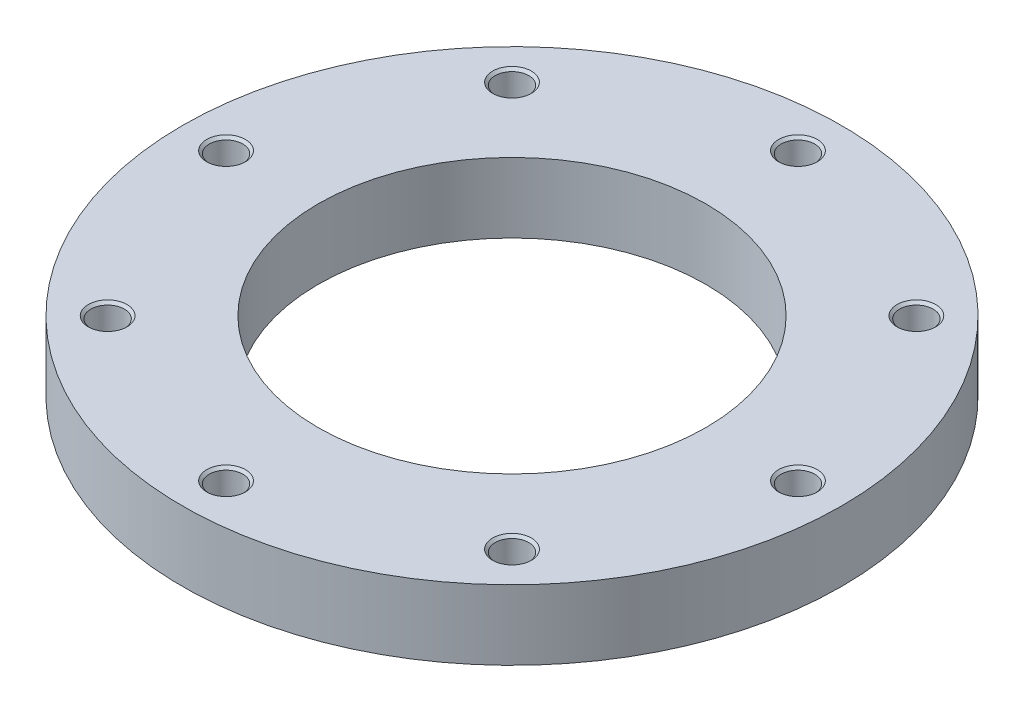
ISO-10303-21;
HEADER;
FILE_DESCRIPTION(('STEP AP214'),'2;1');
FILE_NAME('part.step','',(''),(''),'','','');
FILE_SCHEMA(('AUTOMOTIVE_DESIGN { 1 0 10303 214 1 1 1 1 }'));
ENDSEC;
DATA;
#1=APPLICATION_CONTEXT('core data for automotive mechanical design processes');
#2=APPLICATION_PROTOCOL_DEFINITION('international standard','automotive_design',2000,#1);
#3=PRODUCT_CONTEXT('',#1,'mechanical');
#4=PRODUCT('Part','Part','',(#3));
#5=PRODUCT_RELATED_PRODUCT_CATEGORY('part','',(#4));
#6=PRODUCT_DEFINITION_FORMATION('','',#4);
#7=PRODUCT_DEFINITION_CONTEXT('part definition',#1,'design');
#8=PRODUCT_DEFINITION('design','',#6,#7);
#9=PRODUCT_DEFINITION_SHAPE('','',#8);
#10=(LENGTH_UNIT() NAMED_UNIT(*) SI_UNIT(.MILLI.,.METRE.));
#11=(NAMED_UNIT(*) PLANE_ANGLE_UNIT() SI_UNIT($,.RADIAN.));
#12=(NAMED_UNIT(*) SI_UNIT($,.STERADIAN.) SOLID_ANGLE_UNIT());
#13=UNCERTAINTY_MEASURE_WITH_UNIT(LENGTH_MEASURE(1.E-05),#10,'distance_accuracy_value','');
#14=(GEOMETRIC_REPRESENTATION_CONTEXT(3) GLOBAL_UNCERTAINTY_ASSIGNED_CONTEXT((#13)) GLOBAL_UNIT_ASSIGNED_CONTEXT((#10,
#11,#12)) REPRESENTATION_CONTEXT('',''));
#15=CARTESIAN_POINT('',(0.,0.,0.));
#16=DIRECTION('',(0.,0.,1.));
#17=DIRECTION('',(1.,0.,0.));
#18=AXIS2_PLACEMENT_3D('',#15,#16,#17);
#19=CARTESIAN_POINT('',(0.,18.,0.));
#20=DIRECTION('',(0.,-1.,0.));
#21=DIRECTION('',(1.,0.,0.));
#22=AXIS2_PLACEMENT_3D('',#19,#20,#21);
#23=CYLINDRICAL_SURFACE('',#22,170.);
#24=CARTESIAN_POINT('',(0.,0.,0.));
#25=DIRECTION('',(0.,1.,0.));
#26=DIRECTION('',(1.,0.,0.));
#27=AXIS2_PLACEMENT_3D('',#24,#25,#26);
#28=CIRCLE('',#27,170.);
#29=CARTESIAN_POINT('',(170.,0.,0.));
#30=VERTEX_POINT('',#29);
#31=EDGE_CURVE('E9',#30,#30,#28,.T.);
#32=ORIENTED_EDGE('',*,*,#31,.T.);
#33=EDGE_LOOP('',(#32));
#34=FACE_BOUND('',#33,.T.);
#35=CARTESIAN_POINT('',(0.,36.,0.));
#36=DIRECTION('',(0.,1.,0.));
#37=DIRECTION('',(1.,0.,0.));
#38=AXIS2_PLACEMENT_3D('',#35,#36,#37);
#39=CIRCLE('',#38,170.);
#40=CARTESIAN_POINT('',(170.,36.,0.));
#41=VERTEX_POINT('',#40);
#42=EDGE_CURVE('E179',#41,#41,#39,.T.);
#43=ORIENTED_EDGE('',*,*,#42,.F.);
#44=EDGE_LOOP('',(#43));
#45=FACE_BOUND('',#44,.T.);
#46=ADVANCED_FACE('F15',(#34,#45),#23,.T.);
#47=CARTESIAN_POINT('',(135.,0.,0.));
#48=DIRECTION('',(0.,-1.,0.));
#49=DIRECTION('',(-1.,0.,0.));
#50=AXIS2_PLACEMENT_3D('',#47,#48,#49);
#51=PLANE('',#50);
#52=CARTESIAN_POINT('',(0.,0.,0.));
#53=DIRECTION('',(0.,1.,0.));
#54=DIRECTION('',(1.,0.,0.));
#55=AXIS2_PLACEMENT_3D('',#52,#53,#54);
#56=CIRCLE('',#55,100.);
#57=CARTESIAN_POINT('',(100.,0.,0.));
#58=VERTEX_POINT('',#57);
#59=EDGE_CURVE('E25',#58,#58,#56,.T.);
#60=ORIENTED_EDGE('',*,*,#59,.T.);
#61=EDGE_LOOP('',(#60));
#62=FACE_BOUND('',#61,.T.);
#63=ORIENTED_EDGE('',*,*,#31,.F.);
#64=EDGE_LOOP('',(#63));
#65=FACE_BOUND('',#64,.T.);
#66=ADVANCED_FACE('F372',(#62,#65),#51,.T.);
#67=CARTESIAN_POINT('',(0.,18.,0.));
#68=DIRECTION('',(0.,-1.,0.));
#69=DIRECTION('',(1.,0.,0.));
#70=AXIS2_PLACEMENT_3D('',#67,#68,#69);
#71=CYLINDRICAL_SURFACE('',#70,100.);
#72=CARTESIAN_POINT('',(0.,36.,0.));
#73=DIRECTION('',(0.,1.,0.));
#74=DIRECTION('',(1.,0.,0.));
#75=AXIS2_PLACEMENT_3D('',#72,#73,#74);
#76=CIRCLE('',#75,100.);
#77=CARTESIAN_POINT('',(100.,36.,0.));
#78=VERTEX_POINT('',#77);
#79=EDGE_CURVE('E200',#78,#78,#76,.T.);
#80=ORIENTED_EDGE('',*,*,#79,.T.);
#81=EDGE_LOOP('',(#80));
#82=FACE_BOUND('',#81,.T.);
#83=ORIENTED_EDGE('',*,*,#59,.F.);
#84=EDGE_LOOP('',(#83));
#85=FACE_BOUND('',#84,.T.);
#86=ADVANCED_FACE('F376',(#82,#85),#71,.F.);
#87=CARTESIAN_POINT('',(135.,36.,0.));
#88=DIRECTION('',(0.,1.,0.));
#89=DIRECTION('',(1.,0.,0.));
#90=AXIS2_PLACEMENT_3D('',#87,#88,#89);
#91=PLANE('',#90);
#92=ORIENTED_EDGE('',*,*,#42,.T.);
#93=EDGE_LOOP('',(#92));
#94=FACE_BOUND('',#93,.T.);
#95=ORIENTED_EDGE('',*,*,#79,.F.);
#96=EDGE_LOOP('',(#95));
#97=FACE_BOUND('',#96,.T.);
#98=CARTESIAN_POINT('',(147.5,36.,0.));
#99=DIRECTION('',(0.,-1.,0.));
#100=DIRECTION('',(1.,0.,0.));
#101=AXIS2_PLACEMENT_3D('',#98,#99,#100);
#102=CIRCLE('',#101,10.);
#103=CARTESIAN_POINT('',(157.5,36.,0.));
#104=VERTEX_POINT('',#103);
#105=EDGE_CURVE('E118',#104,#104,#102,.T.);
#106=ORIENTED_EDGE('',*,*,#105,.T.);
#107=EDGE_LOOP('',(#106));
#108=FACE_BOUND('',#107,.T.);
#109=CARTESIAN_POINT('',(104.298250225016,36.,-104.298250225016));
#110=DIRECTION('',(0.,-1.,0.));
#111=DIRECTION('',(0.707106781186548,0.,-0.707106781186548));
#112=AXIS2_PLACEMENT_3D('',#109,#110,#111);
#113=CIRCLE('',#112,10.);
#114=CARTESIAN_POINT('',(111.369318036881,36.,-111.369318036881));
#115=VERTEX_POINT('',#114);
#116=EDGE_CURVE('E134',#115,#115,#113,.T.);
#117=ORIENTED_EDGE('',*,*,#116,.T.);
#118=EDGE_LOOP('',(#117));
#119=FACE_BOUND('',#118,.T.);
#120=CARTESIAN_POINT('',(0.,36.,-147.5));
#121=DIRECTION('',(0.,-1.,0.));
#122=DIRECTION('',(0.,0.,-1.));
#123=AXIS2_PLACEMENT_3D('',#120,#121,#122);
#124=CIRCLE('',#123,10.);
#125=CARTESIAN_POINT('',(0.,36.,-157.5));
#126=VERTEX_POINT('',#125);
#127=EDGE_CURVE('E227',#126,#126,#124,.T.);
#128=ORIENTED_EDGE('',*,*,#127,.T.);
#129=EDGE_LOOP('',(#128));
#130=FACE_BOUND('',#129,.T.);
#131=CARTESIAN_POINT('',(-104.298250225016,36.,-104.298250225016));
#132=DIRECTION('',(0.,-1.,0.));
#133=DIRECTION('',(-0.707106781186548,0.,-0.707106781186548));
#134=AXIS2_PLACEMENT_3D('',#131,#132,#133);
#135=CIRCLE('',#134,10.);
#136=CARTESIAN_POINT('',(-111.369318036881,36.,-111.369318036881));
#137=VERTEX_POINT('',#136);
#138=EDGE_CURVE('E172',#137,#137,#135,.T.);
#139=ORIENTED_EDGE('',*,*,#138,.T.);
#140=EDGE_LOOP('',(#139));
#141=FACE_BOUND('',#140,.T.);
#142=CARTESIAN_POINT('',(-147.5,36.,0.));
#143=DIRECTION('',(0.,-1.,0.));
#144=DIRECTION('',(-1.,0.,0.));
#145=AXIS2_PLACEMENT_3D('',#142,#143,#144);
#146=CIRCLE('',#145,10.);
#147=CARTESIAN_POINT('',(-157.5,36.,0.));
#148=VERTEX_POINT('',#147);
#149=EDGE_CURVE('E197',#148,#148,#146,.T.);
#150=ORIENTED_EDGE('',*,*,#149,.T.);
#151=EDGE_LOOP('',(#150));
#152=FACE_BOUND('',#151,.T.);
#153=CARTESIAN_POINT('',(-104.298250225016,36.,104.298250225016));
#154=DIRECTION('',(0.,-1.,0.));
#155=DIRECTION('',(-0.707106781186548,0.,0.707106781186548));
#156=AXIS2_PLACEMENT_3D('',#153,#154,#155);
#157=CIRCLE('',#156,10.);
#158=CARTESIAN_POINT('',(-111.369318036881,36.,111.369318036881));
#159=VERTEX_POINT('',#158);
#160=EDGE_CURVE('E230',#159,#159,#157,.T.);
#161=ORIENTED_EDGE('',*,*,#160,.T.);
#162=EDGE_LOOP('',(#161));
#163=FACE_BOUND('',#162,.T.);
#164=CARTESIAN_POINT('',(0.,36.,147.5));
#165=DIRECTION('',(0.,-1.,0.));
#166=DIRECTION('',(0.,0.,1.));
#167=AXIS2_PLACEMENT_3D('',#164,#165,#166);
#168=CIRCLE('',#167,10.);
#169=CARTESIAN_POINT('',(0.,36.,157.5));
#170=VERTEX_POINT('',#169);
#171=EDGE_CURVE('E161',#170,#170,#168,.T.);
#172=ORIENTED_EDGE('',*,*,#171,.T.);
#173=EDGE_LOOP('',(#172));
#174=FACE_BOUND('',#173,.T.);
#175=CARTESIAN_POINT('',(104.298250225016,36.,104.298250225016));
#176=DIRECTION('',(0.,-1.,0.));
#177=DIRECTION('',(0.707106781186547,0.,0.707106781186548));
#178=AXIS2_PLACEMENT_3D('',#175,#176,#177);
#179=CIRCLE('',#178,10.);
#180=CARTESIAN_POINT('',(111.369318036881,36.,111.369318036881));
#181=VERTEX_POINT('',#180);
#182=EDGE_CURVE('E182',#181,#181,#179,.T.);
#183=ORIENTED_EDGE('',*,*,#182,.T.);
#184=EDGE_LOOP('',(#183));
#185=FACE_BOUND('',#184,.T.);
#186=ADVANCED_FACE('F119',(#94,#97,#108,#119,#130,#141,#152,#163,#174,#185),#91,.T.);
#187=CARTESIAN_POINT('',(147.5,5.50386219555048,0.));
#188=DIRECTION('',(0.,1.,0.));
#189=DIRECTION('',(1.,0.,0.));
#190=AXIS2_PLACEMENT_3D('',#187,#188,#189);
#191=CONICAL_SURFACE('',#190,4.3234375,1.0471975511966);
#192=CARTESIAN_POINT('',(147.5,8.,0.));
#193=DIRECTION('',(0.,-1.,0.));
#194=DIRECTION('',(1.,0.,0.));
#195=AXIS2_PLACEMENT_3D('',#192,#193,#194);
#196=CIRCLE('',#195,8.646875);
#197=CARTESIAN_POINT('',(156.146875,8.,0.));
#198=VERTEX_POINT('',#197);
#199=EDGE_CURVE('E142',#198,#198,#196,.T.);
#200=ORIENTED_EDGE('',*,*,#199,.F.);
#201=EDGE_LOOP('',(#200));
#202=FACE_BOUND('',#201,.T.);
#203=CARTESIAN_POINT('',(147.5,3.00772439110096,0.));
#204=VERTEX_POINT('',#203);
#205=VERTEX_LOOP('',#204);
#206=FACE_BOUND('',#205,.T.);
#207=ADVANCED_FACE('F399',(#202,#206),#191,.F.);
#208=CARTESIAN_POINT('',(147.5,11.3234375,0.));
#209=DIRECTION('',(0.,1.,0.));
#210=DIRECTION('',(1.,0.,0.));
#211=AXIS2_PLACEMENT_3D('',#208,#209,#210);
#212=CYLINDRICAL_SURFACE('',#211,8.646875);
#213=CARTESIAN_POINT('',(147.5,14.646875,0.));
#214=DIRECTION('',(0.,-1.,0.));
#215=DIRECTION('',(1.,0.,0.));
#216=AXIS2_PLACEMENT_3D('',#213,#214,#215);
#217=CIRCLE('',#216,8.646875);
#218=CARTESIAN_POINT('',(156.146875,14.646875,0.));
#219=VERTEX_POINT('',#218);
#220=EDGE_CURVE('E139',#219,#219,#217,.T.);
#221=ORIENTED_EDGE('',*,*,#220,.F.);
#222=EDGE_LOOP('',(#221));
#223=FACE_BOUND('',#222,.T.);
#224=ORIENTED_EDGE('',*,*,#199,.T.);
#225=EDGE_LOOP('',(#224));
#226=FACE_BOUND('',#225,.T.);
#227=ADVANCED_FACE('F402',(#223,#226),#212,.F.);
#228=CARTESIAN_POINT('',(147.5,15.3234375,0.));
#229=DIRECTION('',(0.,1.,0.));
#230=DIRECTION('',(1.,0.,0.));
#231=AXIS2_PLACEMENT_3D('',#228,#229,#230);
#232=CONICAL_SURFACE('',#231,9.3234375,0.785398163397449);
#233=CARTESIAN_POINT('',(147.5,16.,0.));
#234=DIRECTION('',(0.,-1.,0.));
#235=DIRECTION('',(1.,0.,0.));
#236=AXIS2_PLACEMENT_3D('',#233,#234,#235);
#237=CIRCLE('',#236,10.);
#238=CARTESIAN_POINT('',(157.5,16.,0.));
#239=VERTEX_POINT('',#238);
#240=EDGE_CURVE('E125',#239,#239,#237,.T.);
#241=ORIENTED_EDGE('',*,*,#240,.F.);
#242=EDGE_LOOP('',(#241));
#243=FACE_BOUND('',#242,.T.);
#244=ORIENTED_EDGE('',*,*,#220,.T.);
#245=EDGE_LOOP('',(#244));
#246=FACE_BOUND('',#245,.T.);
#247=ADVANCED_FACE('F431',(#243,#246),#232,.F.);
#248=CARTESIAN_POINT('',(156.8234375,16.,0.));
#249=DIRECTION('',(0.,1.,0.));
#250=DIRECTION('',(-1.,0.,0.));
#251=AXIS2_PLACEMENT_3D('',#248,#249,#250);
#252=PLANE('',#251);
#253=CARTESIAN_POINT('',(147.5,16.,0.));
#254=DIRECTION('',(0.,-1.,0.));
#255=DIRECTION('',(1.,0.,0.));
#256=AXIS2_PLACEMENT_3D('',#253,#254,#255);
#257=CIRCLE('',#256,8.646875);
#258=CARTESIAN_POINT('',(156.146875,16.,0.));
#259=VERTEX_POINT('',#258);
#260=EDGE_CURVE('E122',#259,#259,#257,.T.);
#261=ORIENTED_EDGE('',*,*,#260,.F.);
#262=EDGE_LOOP('',(#261));
#263=FACE_BOUND('',#262,.T.);
#264=ORIENTED_EDGE('',*,*,#240,.T.);
#265=EDGE_LOOP('',(#264));
#266=FACE_BOUND('',#265,.T.);
#267=ADVANCED_FACE('F428',(#263,#266),#252,.F.);
#268=CARTESIAN_POINT('',(147.5,25.3234375,0.));
#269=DIRECTION('',(0.,1.,0.));
#270=DIRECTION('',(1.,0.,0.));
#271=AXIS2_PLACEMENT_3D('',#268,#269,#270);
#272=CYLINDRICAL_SURFACE('',#271,8.646875);
#273=CARTESIAN_POINT('',(147.5,34.646875,0.));
#274=DIRECTION('',(0.,-1.,0.));
#275=DIRECTION('',(1.,0.,0.));
#276=AXIS2_PLACEMENT_3D('',#273,#274,#275);
#277=CIRCLE('',#276,8.646875);
#278=CARTESIAN_POINT('',(156.146875,34.646875,0.));
#279=VERTEX_POINT('',#278);
#280=EDGE_CURVE('E123',#279,#279,#277,.T.);
#281=ORIENTED_EDGE('',*,*,#280,.F.);
#282=EDGE_LOOP('',(#281));
#283=FACE_BOUND('',#282,.T.);
#284=ORIENTED_EDGE('',*,*,#260,.T.);
#285=EDGE_LOOP('',(#284));
#286=FACE_BOUND('',#285,.T.);
#287=ADVANCED_FACE('F426',(#283,#286),#272,.F.);
#288=CARTESIAN_POINT('',(147.5,35.3234375,0.));
#289=DIRECTION('',(0.,1.,0.));
#290=DIRECTION('',(1.,0.,0.));
#291=AXIS2_PLACEMENT_3D('',#288,#289,#290);
#292=CONICAL_SURFACE('',#291,9.3234375,0.785398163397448);
#293=ORIENTED_EDGE('',*,*,#105,.F.);
#294=EDGE_LOOP('',(#293));
#295=FACE_BOUND('',#294,.T.);
#296=ORIENTED_EDGE('',*,*,#280,.T.);
#297=EDGE_LOOP('',(#296));
#298=FACE_BOUND('',#297,.T.);
#299=ADVANCED_FACE('F424',(#295,#298),#292,.F.);
#300=CARTESIAN_POINT('',(104.298250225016,5.50386219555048,-104.298250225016));
#301=DIRECTION('',(0.,1.,0.));
#302=DIRECTION('',(0.707106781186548,0.,-0.707106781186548));
#303=AXIS2_PLACEMENT_3D('',#300,#301,#302);
#304=CONICAL_SURFACE('',#303,4.3234375,1.0471975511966);
#305=CARTESIAN_POINT('',(104.298250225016,8.,-104.298250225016));
#306=DIRECTION('',(0.,-1.,0.));
#307=DIRECTION('',(0.707106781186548,0.,-0.707106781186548));
#308=AXIS2_PLACEMENT_3D('',#305,#306,#307);
#309=CIRCLE('',#308,8.646875);
#310=CARTESIAN_POINT('',(110.412514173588,8.,-110.412514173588));
#311=VERTEX_POINT('',#310);
#312=EDGE_CURVE('E127',#311,#311,#309,.T.);
#313=ORIENTED_EDGE('',*,*,#312,.F.);
#314=EDGE_LOOP('',(#313));
#315=FACE_BOUND('',#314,.T.);
#316=CARTESIAN_POINT('',(104.298250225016,3.00772439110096,-104.298250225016));
#317=VERTEX_POINT('',#316);
#318=VERTEX_LOOP('',#317);
#319=FACE_BOUND('',#318,.T.);
#320=ADVANCED_FACE('F366',(#315,#319),#304,.F.);
#321=CARTESIAN_POINT('',(104.298250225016,11.3234375,-104.298250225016));
#322=DIRECTION('',(0.,1.,0.));
#323=DIRECTION('',(0.707106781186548,0.,-0.707106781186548));
#324=AXIS2_PLACEMENT_3D('',#321,#322,#323);
#325=CYLINDRICAL_SURFACE('',#324,8.646875);
#326=CARTESIAN_POINT('',(104.298250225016,14.646875,-104.298250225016));
#327=DIRECTION('',(0.,-1.,0.));
#328=DIRECTION('',(0.707106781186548,0.,-0.707106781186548));
#329=AXIS2_PLACEMENT_3D('',#326,#327,#328);
#330=CIRCLE('',#329,8.646875);
#331=CARTESIAN_POINT('',(110.412514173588,14.646875,-110.412514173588));
#332=VERTEX_POINT('',#331);
#333=EDGE_CURVE('E167',#332,#332,#330,.T.);
#334=ORIENTED_EDGE('',*,*,#333,.F.);
#335=EDGE_LOOP('',(#334));
#336=FACE_BOUND('',#335,.T.);
#337=ORIENTED_EDGE('',*,*,#312,.T.);
#338=EDGE_LOOP('',(#337));
#339=FACE_BOUND('',#338,.T.);
#340=ADVANCED_FACE('F360',(#336,#339),#325,.F.);
#341=CARTESIAN_POINT('',(104.298250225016,15.3234375,-104.298250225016));
#342=DIRECTION('',(0.,1.,0.));
#343=DIRECTION('',(0.707106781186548,0.,-0.707106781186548));
#344=AXIS2_PLACEMENT_3D('',#341,#342,#343);
#345=CONICAL_SURFACE('',#344,9.3234375,0.785398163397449);
#346=CARTESIAN_POINT('',(104.298250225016,16.,-104.298250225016));
#347=DIRECTION('',(0.,-1.,0.));
#348=DIRECTION('',(0.707106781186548,0.,-0.707106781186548));
#349=AXIS2_PLACEMENT_3D('',#346,#347,#348);
#350=CIRCLE('',#349,10.);
#351=CARTESIAN_POINT('',(111.369318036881,16.,-111.369318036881));
#352=VERTEX_POINT('',#351);
#353=EDGE_CURVE('E133',#352,#352,#350,.T.);
#354=ORIENTED_EDGE('',*,*,#353,.F.);
#355=EDGE_LOOP('',(#354));
#356=FACE_BOUND('',#355,.T.);
#357=ORIENTED_EDGE('',*,*,#333,.T.);
#358=EDGE_LOOP('',(#357));
#359=FACE_BOUND('',#358,.T.);
#360=ADVANCED_FACE('F355',(#356,#359),#345,.F.);
#361=CARTESIAN_POINT('',(110.890916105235,16.,-110.890916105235));
#362=DIRECTION('',(0.,1.,0.));
#363=DIRECTION('',(-0.707106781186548,0.,0.707106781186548));
#364=AXIS2_PLACEMENT_3D('',#361,#362,#363);
#365=PLANE('',#364);
#366=CARTESIAN_POINT('',(104.298250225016,16.,-104.298250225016));
#367=DIRECTION('',(0.,-1.,0.));
#368=DIRECTION('',(0.707106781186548,0.,-0.707106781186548));
#369=AXIS2_PLACEMENT_3D('',#366,#367,#368);
#370=CIRCLE('',#369,8.646875);
#371=CARTESIAN_POINT('',(110.412514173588,16.,-110.412514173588));
#372=VERTEX_POINT('',#371);
#373=EDGE_CURVE('E131',#372,#372,#370,.T.);
#374=ORIENTED_EDGE('',*,*,#373,.F.);
#375=EDGE_LOOP('',(#374));
#376=FACE_BOUND('',#375,.T.);
#377=ORIENTED_EDGE('',*,*,#353,.T.);
#378=EDGE_LOOP('',(#377));
#379=FACE_BOUND('',#378,.T.);
#380=ADVANCED_FACE('F349',(#376,#379),#365,.F.);
#381=CARTESIAN_POINT('',(104.298250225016,25.3234375,-104.298250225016));
#382=DIRECTION('',(0.,1.,0.));
#383=DIRECTION('',(0.707106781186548,0.,-0.707106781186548));
#384=AXIS2_PLACEMENT_3D('',#381,#382,#383);
#385=CYLINDRICAL_SURFACE('',#384,8.646875);
#386=CARTESIAN_POINT('',(104.298250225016,34.646875,-104.298250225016));
#387=DIRECTION('',(0.,-1.,0.));
#388=DIRECTION('',(0.707106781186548,0.,-0.707106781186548));
#389=AXIS2_PLACEMENT_3D('',#386,#387,#388);
#390=CIRCLE('',#389,8.646875);
#391=CARTESIAN_POINT('',(110.412514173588,34.646875,-110.412514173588));
#392=VERTEX_POINT('',#391);
#393=EDGE_CURVE('E155',#392,#392,#390,.T.);
#394=ORIENTED_EDGE('',*,*,#393,.F.);
#395=EDGE_LOOP('',(#394));
#396=FACE_BOUND('',#395,.T.);
#397=ORIENTED_EDGE('',*,*,#373,.T.);
#398=EDGE_LOOP('',(#397));
#399=FACE_BOUND('',#398,.T.);
#400=ADVANCED_FACE('F346',(#396,#399),#385,.F.);
#401=CARTESIAN_POINT('',(104.298250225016,35.3234375,-104.298250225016));
#402=DIRECTION('',(0.,1.,0.));
#403=DIRECTION('',(0.707106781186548,0.,-0.707106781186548));
#404=AXIS2_PLACEMENT_3D('',#401,#402,#403);
#405=CONICAL_SURFACE('',#404,9.3234375,0.785398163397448);
#406=ORIENTED_EDGE('',*,*,#116,.F.);
#407=EDGE_LOOP('',(#406));
#408=FACE_BOUND('',#407,.T.);
#409=ORIENTED_EDGE('',*,*,#393,.T.);
#410=EDGE_LOOP('',(#409));
#411=FACE_BOUND('',#410,.T.);
#412=ADVANCED_FACE('F293',(#408,#411),#405,.F.);
#413=CARTESIAN_POINT('',(0.,5.50386219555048,-147.5));
#414=DIRECTION('',(0.,1.,0.));
#415=DIRECTION('',(0.,0.,-1.));
#416=AXIS2_PLACEMENT_3D('',#413,#414,#415);
#417=CONICAL_SURFACE('',#416,4.3234375,1.0471975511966);
#418=CARTESIAN_POINT('',(0.,8.,-147.5));
#419=DIRECTION('',(0.,-1.,0.));
#420=DIRECTION('',(0.,0.,-1.));
#421=AXIS2_PLACEMENT_3D('',#418,#419,#420);
#422=CIRCLE('',#421,8.646875);
#423=CARTESIAN_POINT('',(0.,8.,-156.146875));
#424=VERTEX_POINT('',#423);
#425=EDGE_CURVE('E137',#424,#424,#422,.T.);
#426=ORIENTED_EDGE('',*,*,#425,.F.);
#427=EDGE_LOOP('',(#426));
#428=FACE_BOUND('',#427,.T.);
#429=CARTESIAN_POINT('',(0.,3.00772439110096,-147.5));
#430=VERTEX_POINT('',#429);
#431=VERTEX_LOOP('',#430);
#432=FACE_BOUND('',#431,.T.);
#433=ADVANCED_FACE('F287',(#428,#432),#417,.F.);
#434=CARTESIAN_POINT('',(0.,11.3234375,-147.5));
#435=DIRECTION('',(0.,1.,0.));
#436=DIRECTION('',(0.,0.,-1.));
#437=AXIS2_PLACEMENT_3D('',#434,#435,#436);
#438=CYLINDRICAL_SURFACE('',#437,8.646875);
#439=CARTESIAN_POINT('',(0.,14.646875,-147.5));
#440=DIRECTION('',(0.,-1.,0.));
#441=DIRECTION('',(0.,0.,-1.));
#442=AXIS2_PLACEMENT_3D('',#439,#440,#441);
#443=CIRCLE('',#442,8.646875);
#444=CARTESIAN_POINT('',(0.,14.646875,-156.146875));
#445=VERTEX_POINT('',#444);
#446=EDGE_CURVE('E135',#445,#445,#443,.T.);
#447=ORIENTED_EDGE('',*,*,#446,.F.);
#448=EDGE_LOOP('',(#447));
#449=FACE_BOUND('',#448,.T.);
#450=ORIENTED_EDGE('',*,*,#425,.T.);
#451=EDGE_LOOP('',(#450));
#452=FACE_BOUND('',#451,.T.);
#453=ADVANCED_FACE('F281',(#449,#452),#438,.F.);
#454=CARTESIAN_POINT('',(0.,15.3234375,-147.5));
#455=DIRECTION('',(0.,1.,0.));
#456=DIRECTION('',(0.,0.,-1.));
#457=AXIS2_PLACEMENT_3D('',#454,#455,#456);
#458=CONICAL_SURFACE('',#457,9.3234375,0.785398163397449);
#459=CARTESIAN_POINT('',(0.,16.,-147.5));
#460=DIRECTION('',(0.,-1.,0.));
#461=DIRECTION('',(0.,0.,-1.));
#462=AXIS2_PLACEMENT_3D('',#459,#460,#461);
#463=CIRCLE('',#462,10.);
#464=CARTESIAN_POINT('',(0.,16.,-157.5));
#465=VERTEX_POINT('',#464);
#466=EDGE_CURVE('E138',#465,#465,#463,.T.);
#467=ORIENTED_EDGE('',*,*,#466,.F.);
#468=EDGE_LOOP('',(#467));
#469=FACE_BOUND('',#468,.T.);
#470=ORIENTED_EDGE('',*,*,#446,.T.);
#471=EDGE_LOOP('',(#470));
#472=FACE_BOUND('',#471,.T.);
#473=ADVANCED_FACE('F274',(#469,#472),#458,.F.);
#474=CARTESIAN_POINT('',(0.,16.,-156.8234375));
#475=DIRECTION('',(0.,1.,0.));
#476=DIRECTION('',(0.,0.,1.));
#477=AXIS2_PLACEMENT_3D('',#474,#475,#476);
#478=PLANE('',#477);
#479=CARTESIAN_POINT('',(0.,16.,-147.5));
#480=DIRECTION('',(0.,-1.,0.));
#481=DIRECTION('',(0.,0.,-1.));
#482=AXIS2_PLACEMENT_3D('',#479,#480,#481);
#483=CIRCLE('',#482,8.646875);
#484=CARTESIAN_POINT('',(0.,16.,-156.146875));
#485=VERTEX_POINT('',#484);
#486=EDGE_CURVE('E219',#485,#485,#483,.T.);
#487=ORIENTED_EDGE('',*,*,#486,.F.);
#488=EDGE_LOOP('',(#487));
#489=FACE_BOUND('',#488,.T.);
#490=ORIENTED_EDGE('',*,*,#466,.T.);
#491=EDGE_LOOP('',(#490));
#492=FACE_BOUND('',#491,.T.);
#493=ADVANCED_FACE('F267',(#489,#492),#478,.F.);
#494=CARTESIAN_POINT('',(0.,25.3234375,-147.5));
#495=DIRECTION('',(0.,1.,0.));
#496=DIRECTION('',(0.,0.,-1.));
#497=AXIS2_PLACEMENT_3D('',#494,#495,#496);
#498=CYLINDRICAL_SURFACE('',#497,8.646875);
#499=CARTESIAN_POINT('',(0.,34.646875,-147.5));
#500=DIRECTION('',(0.,-1.,0.));
#501=DIRECTION('',(0.,0.,-1.));
#502=AXIS2_PLACEMENT_3D('',#499,#500,#501);
#503=CIRCLE('',#502,8.646875);
#504=CARTESIAN_POINT('',(0.,34.646875,-156.146875));
#505=VERTEX_POINT('',#504);
#506=EDGE_CURVE('E176',#505,#505,#503,.T.);
#507=ORIENTED_EDGE('',*,*,#506,.F.);
#508=EDGE_LOOP('',(#507));
#509=FACE_BOUND('',#508,.T.);
#510=ORIENTED_EDGE('',*,*,#486,.T.);
#511=EDGE_LOOP('',(#510));
#512=FACE_BOUND('',#511,.T.);
#513=ADVANCED_FACE('F259',(#509,#512),#498,.F.);
#514=CARTESIAN_POINT('',(0.,35.3234375,-147.5));
#515=DIRECTION('',(0.,1.,0.));
#516=DIRECTION('',(0.,0.,-1.));
#517=AXIS2_PLACEMENT_3D('',#514,#515,#516);
#518=CONICAL_SURFACE('',#517,9.3234375,0.785398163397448);
#519=ORIENTED_EDGE('',*,*,#127,.F.);
#520=EDGE_LOOP('',(#519));
#521=FACE_BOUND('',#520,.T.);
#522=ORIENTED_EDGE('',*,*,#506,.T.);
#523=EDGE_LOOP('',(#522));
#524=FACE_BOUND('',#523,.T.);
#525=ADVANCED_FACE('F255',(#521,#524),#518,.F.);
#526=CARTESIAN_POINT('',(-104.298250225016,5.50386219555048,-104.298250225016));
#527=DIRECTION('',(0.,1.,0.));
#528=DIRECTION('',(-0.707106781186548,0.,-0.707106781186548));
#529=AXIS2_PLACEMENT_3D('',#526,#527,#528);
#530=CONICAL_SURFACE('',#529,4.3234375,1.0471975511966);
#531=CARTESIAN_POINT('',(-104.298250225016,8.,-104.298250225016));
#532=DIRECTION('',(0.,-1.,0.));
#533=DIRECTION('',(-0.707106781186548,0.,-0.707106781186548));
#534=AXIS2_PLACEMENT_3D('',#531,#532,#533);
#535=CIRCLE('',#534,8.646875);
#536=CARTESIAN_POINT('',(-110.412514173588,8.,-110.412514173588));
#537=VERTEX_POINT('',#536);
#538=EDGE_CURVE('E173',#537,#537,#535,.T.);
#539=ORIENTED_EDGE('',*,*,#538,.F.);
#540=EDGE_LOOP('',(#539));
#541=FACE_BOUND('',#540,.T.);
#542=CARTESIAN_POINT('',(-104.298250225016,3.00772439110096,-104.298250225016));
#543=VERTEX_POINT('',#542);
#544=VERTEX_LOOP('',#543);
#545=FACE_BOUND('',#544,.T.);
#546=ADVANCED_FACE('F258',(#541,#545),#530,.F.);
#547=CARTESIAN_POINT('',(-104.298250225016,11.3234375,-104.298250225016));
#548=DIRECTION('',(0.,1.,0.));
#549=DIRECTION('',(-0.707106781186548,0.,-0.707106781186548));
#550=AXIS2_PLACEMENT_3D('',#547,#548,#549);
#551=CYLINDRICAL_SURFACE('',#550,8.646875);
#552=CARTESIAN_POINT('',(-104.298250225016,14.646875,-104.298250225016));
#553=DIRECTION('',(0.,-1.,0.));
#554=DIRECTION('',(-0.707106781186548,0.,-0.707106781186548));
#555=AXIS2_PLACEMENT_3D('',#552,#553,#554);
#556=CIRCLE('',#555,8.646875);
#557=CARTESIAN_POINT('',(-110.412514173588,14.646875,-110.412514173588));
#558=VERTEX_POINT('',#557);
#559=EDGE_CURVE('E177',#558,#558,#556,.T.);
#560=ORIENTED_EDGE('',*,*,#559,.F.);
#561=EDGE_LOOP('',(#560));
#562=FACE_BOUND('',#561,.T.);
#563=ORIENTED_EDGE('',*,*,#538,.T.);
#564=EDGE_LOOP('',(#563));
#565=FACE_BOUND('',#564,.T.);
#566=ADVANCED_FACE('F448',(#562,#565),#551,.F.);
#567=CARTESIAN_POINT('',(-104.298250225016,15.3234375,-104.298250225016));
#568=DIRECTION('',(0.,1.,0.));
#569=DIRECTION('',(-0.707106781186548,0.,-0.707106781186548));
#570=AXIS2_PLACEMENT_3D('',#567,#568,#569);
#571=CONICAL_SURFACE('',#570,9.3234375,0.785398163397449);
#572=CARTESIAN_POINT('',(-104.298250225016,16.,-104.298250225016));
#573=DIRECTION('',(0.,-1.,0.));
#574=DIRECTION('',(-0.707106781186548,0.,-0.707106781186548));
#575=AXIS2_PLACEMENT_3D('',#572,#573,#574);
#576=CIRCLE('',#575,10.);
#577=CARTESIAN_POINT('',(-111.369318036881,16.,-111.369318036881));
#578=VERTEX_POINT('',#577);
#579=EDGE_CURVE('E171',#578,#578,#576,.T.);
#580=ORIENTED_EDGE('',*,*,#579,.F.);
#581=EDGE_LOOP('',(#580));
#582=FACE_BOUND('',#581,.T.);
#583=ORIENTED_EDGE('',*,*,#559,.T.);
#584=EDGE_LOOP('',(#583));
#585=FACE_BOUND('',#584,.T.);
#586=ADVANCED_FACE('F443',(#582,#585),#571,.F.);
#587=CARTESIAN_POINT('',(-110.890916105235,16.,-110.890916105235));
#588=DIRECTION('',(0.,1.,0.));
#589=DIRECTION('',(0.707106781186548,0.,0.707106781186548));
#590=AXIS2_PLACEMENT_3D('',#587,#588,#589);
#591=PLANE('',#590);
#592=CARTESIAN_POINT('',(-104.298250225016,16.,-104.298250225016));
#593=DIRECTION('',(0.,-1.,0.));
#594=DIRECTION('',(-0.707106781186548,0.,-0.707106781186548));
#595=AXIS2_PLACEMENT_3D('',#592,#593,#594);
#596=CIRCLE('',#595,8.646875);
#597=CARTESIAN_POINT('',(-110.412514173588,16.,-110.412514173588));
#598=VERTEX_POINT('',#597);
#599=EDGE_CURVE('E168',#598,#598,#596,.T.);
#600=ORIENTED_EDGE('',*,*,#599,.F.);
#601=EDGE_LOOP('',(#600));
#602=FACE_BOUND('',#601,.T.);
#603=ORIENTED_EDGE('',*,*,#579,.T.);
#604=EDGE_LOOP('',(#603));
#605=FACE_BOUND('',#604,.T.);
#606=ADVANCED_FACE('F440',(#602,#605),#591,.F.);
#607=CARTESIAN_POINT('',(-104.298250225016,25.3234375,-104.298250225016));
#608=DIRECTION('',(0.,1.,0.));
#609=DIRECTION('',(-0.707106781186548,0.,-0.707106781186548));
#610=AXIS2_PLACEMENT_3D('',#607,#608,#609);
#611=CYLINDRICAL_SURFACE('',#610,8.646875);
#612=CARTESIAN_POINT('',(-104.298250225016,34.646875,-104.298250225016));
#613=DIRECTION('',(0.,-1.,0.));
#614=DIRECTION('',(-0.707106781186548,0.,-0.707106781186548));
#615=AXIS2_PLACEMENT_3D('',#612,#613,#614);
#616=CIRCLE('',#615,8.646875);
#617=CARTESIAN_POINT('',(-110.412514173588,34.646875,-110.412514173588));
#618=VERTEX_POINT('',#617);
#619=EDGE_CURVE('E204',#618,#618,#616,.T.);
#620=ORIENTED_EDGE('',*,*,#619,.F.);
#621=EDGE_LOOP('',(#620));
#622=FACE_BOUND('',#621,.T.);
#623=ORIENTED_EDGE('',*,*,#599,.T.);
#624=EDGE_LOOP('',(#623));
#625=FACE_BOUND('',#624,.T.);
#626=ADVANCED_FACE('F385',(#622,#625),#611,.F.);
#627=CARTESIAN_POINT('',(-104.298250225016,35.3234375,-104.298250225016));
#628=DIRECTION('',(0.,1.,0.));
#629=DIRECTION('',(-0.707106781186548,0.,-0.707106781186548));
#630=AXIS2_PLACEMENT_3D('',#627,#628,#629);
#631=CONICAL_SURFACE('',#630,9.3234375,0.785398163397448);
#632=ORIENTED_EDGE('',*,*,#138,.F.);
#633=EDGE_LOOP('',(#632));
#634=FACE_BOUND('',#633,.T.);
#635=ORIENTED_EDGE('',*,*,#619,.T.);
#636=EDGE_LOOP('',(#635));
#637=FACE_BOUND('',#636,.T.);
#638=ADVANCED_FACE('F381',(#634,#637),#631,.F.);
#639=CARTESIAN_POINT('',(-147.5,5.50386219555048,0.));
#640=DIRECTION('',(0.,1.,0.));
#641=DIRECTION('',(-1.,0.,0.));
#642=AXIS2_PLACEMENT_3D('',#639,#640,#641);
#643=CONICAL_SURFACE('',#642,4.3234375,1.0471975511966);
#644=CARTESIAN_POINT('',(-147.5,8.,0.));
#645=DIRECTION('',(0.,-1.,0.));
#646=DIRECTION('',(-1.,0.,0.));
#647=AXIS2_PLACEMENT_3D('',#644,#645,#646);
#648=CIRCLE('',#647,8.646875);
#649=CARTESIAN_POINT('',(-156.146875,8.,0.));
#650=VERTEX_POINT('',#649);
#651=EDGE_CURVE('E19',#650,#650,#648,.T.);
#652=ORIENTED_EDGE('',*,*,#651,.F.);
#653=EDGE_LOOP('',(#652));
#654=FACE_BOUND('',#653,.T.);
#655=CARTESIAN_POINT('',(-147.5,3.00772439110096,0.));
#656=VERTEX_POINT('',#655);
#657=VERTEX_LOOP('',#656);
#658=FACE_BOUND('',#657,.T.);
#659=ADVANCED_FACE('F384',(#654,#658),#643,.F.);
#660=CARTESIAN_POINT('',(-147.5,11.3234375,0.));
#661=DIRECTION('',(0.,1.,0.));
#662=DIRECTION('',(-1.,0.,0.));
#663=AXIS2_PLACEMENT_3D('',#660,#661,#662);
#664=CYLINDRICAL_SURFACE('',#663,8.646875);
#665=CARTESIAN_POINT('',(-147.5,14.646875,0.));
#666=DIRECTION('',(0.,-1.,0.));
#667=DIRECTION('',(-1.,0.,0.));
#668=AXIS2_PLACEMENT_3D('',#665,#666,#667);
#669=CIRCLE('',#668,8.646875);
#670=CARTESIAN_POINT('',(-156.146875,14.646875,0.));
#671=VERTEX_POINT('',#670);
#672=EDGE_CURVE('E205',#671,#671,#669,.T.);
#673=ORIENTED_EDGE('',*,*,#672,.F.);
#674=EDGE_LOOP('',(#673));
#675=FACE_BOUND('',#674,.T.);
#676=ORIENTED_EDGE('',*,*,#651,.T.);
#677=EDGE_LOOP('',(#676));
#678=FACE_BOUND('',#677,.T.);
#679=ADVANCED_FACE('F505',(#675,#678),#664,.F.);
#680=CARTESIAN_POINT('',(-147.5,15.3234375,0.));
#681=DIRECTION('',(0.,1.,0.));
#682=DIRECTION('',(-1.,0.,0.));
#683=AXIS2_PLACEMENT_3D('',#680,#681,#682);
#684=CONICAL_SURFACE('',#683,9.3234375,0.785398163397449);
#685=CARTESIAN_POINT('',(-147.5,16.,0.));
#686=DIRECTION('',(0.,-1.,0.));
#687=DIRECTION('',(-1.,0.,0.));
#688=AXIS2_PLACEMENT_3D('',#685,#686,#687);
#689=CIRCLE('',#688,10.);
#690=CARTESIAN_POINT('',(-157.5,16.,0.));
#691=VERTEX_POINT('',#690);
#692=EDGE_CURVE('E207',#691,#691,#689,.T.);
#693=ORIENTED_EDGE('',*,*,#692,.F.);
#694=EDGE_LOOP('',(#693));
#695=FACE_BOUND('',#694,.T.);
#696=ORIENTED_EDGE('',*,*,#672,.T.);
#697=EDGE_LOOP('',(#696));
#698=FACE_BOUND('',#697,.T.);
#699=ADVANCED_FACE('F501',(#695,#698),#684,.F.);
#700=CARTESIAN_POINT('',(-156.8234375,16.,0.));
#701=DIRECTION('',(0.,1.,0.));
#702=DIRECTION('',(1.,0.,0.));
#703=AXIS2_PLACEMENT_3D('',#700,#701,#702);
#704=PLANE('',#703);
#705=CARTESIAN_POINT('',(-147.5,16.,0.));
#706=DIRECTION('',(0.,-1.,0.));
#707=DIRECTION('',(-1.,0.,0.));
#708=AXIS2_PLACEMENT_3D('',#705,#706,#707);
#709=CIRCLE('',#708,8.646875);
#710=CARTESIAN_POINT('',(-156.146875,16.,0.));
#711=VERTEX_POINT('',#710);
#712=EDGE_CURVE('E212',#711,#711,#709,.T.);
#713=ORIENTED_EDGE('',*,*,#712,.F.);
#714=EDGE_LOOP('',(#713));
#715=FACE_BOUND('',#714,.T.);
#716=ORIENTED_EDGE('',*,*,#692,.T.);
#717=EDGE_LOOP('',(#716));
#718=FACE_BOUND('',#717,.T.);
#719=ADVANCED_FACE('F504',(#715,#718),#704,.F.);
#720=CARTESIAN_POINT('',(-147.5,25.3234375,0.));
#721=DIRECTION('',(0.,1.,0.));
#722=DIRECTION('',(-1.,0.,0.));
#723=AXIS2_PLACEMENT_3D('',#720,#721,#722);
#724=CYLINDRICAL_SURFACE('',#723,8.646875);
#725=CARTESIAN_POINT('',(-147.5,34.646875,0.));
#726=DIRECTION('',(0.,-1.,0.));
#727=DIRECTION('',(-1.,0.,0.));
#728=AXIS2_PLACEMENT_3D('',#725,#726,#727);
#729=CIRCLE('',#728,8.646875);
#730=CARTESIAN_POINT('',(-156.146875,34.646875,0.));
#731=VERTEX_POINT('',#730);
#732=EDGE_CURVE('E193',#731,#731,#729,.T.);
#733=ORIENTED_EDGE('',*,*,#732,.F.);
#734=EDGE_LOOP('',(#733));
#735=FACE_BOUND('',#734,.T.);
#736=ORIENTED_EDGE('',*,*,#712,.T.);
#737=EDGE_LOOP('',(#736));
#738=FACE_BOUND('',#737,.T.);
#739=ADVANCED_FACE('F17',(#735,#738),#724,.F.);
#740=CARTESIAN_POINT('',(-147.5,35.3234375,0.));
#741=DIRECTION('',(0.,1.,0.));
#742=DIRECTION('',(-1.,0.,0.));
#743=AXIS2_PLACEMENT_3D('',#740,#741,#742);
#744=CONICAL_SURFACE('',#743,9.3234375,0.785398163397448);
#745=ORIENTED_EDGE('',*,*,#149,.F.);
#746=EDGE_LOOP('',(#745));
#747=FACE_BOUND('',#746,.T.);
#748=ORIENTED_EDGE('',*,*,#732,.T.);
#749=EDGE_LOOP('',(#748));
#750=FACE_BOUND('',#749,.T.);
#751=ADVANCED_FACE('F413',(#747,#750),#744,.F.);
#752=CARTESIAN_POINT('',(-104.298250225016,5.50386219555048,104.298250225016));
#753=DIRECTION('',(0.,1.,0.));
#754=DIRECTION('',(-0.707106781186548,0.,0.707106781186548));
#755=AXIS2_PLACEMENT_3D('',#752,#753,#754);
#756=CONICAL_SURFACE('',#755,4.3234375,1.0471975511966);
#757=CARTESIAN_POINT('',(-104.298250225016,8.,104.298250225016));
#758=DIRECTION('',(0.,-1.,0.));
#759=DIRECTION('',(-0.707106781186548,0.,0.707106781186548));
#760=AXIS2_PLACEMENT_3D('',#757,#758,#759);
#761=CIRCLE('',#760,8.646875);
#762=CARTESIAN_POINT('',(-110.412514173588,8.,110.412514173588));
#763=VERTEX_POINT('',#762);
#764=EDGE_CURVE('E190',#763,#763,#761,.T.);
#765=ORIENTED_EDGE('',*,*,#764,.F.);
#766=EDGE_LOOP('',(#765));
#767=FACE_BOUND('',#766,.T.);
#768=CARTESIAN_POINT('',(-104.298250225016,3.00772439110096,104.298250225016));
#769=VERTEX_POINT('',#768);
#770=VERTEX_LOOP('',#769);
#771=FACE_BOUND('',#770,.T.);
#772=ADVANCED_FACE('F416',(#767,#771),#756,.F.);
#773=CARTESIAN_POINT('',(-104.298250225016,11.3234375,104.298250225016));
#774=DIRECTION('',(0.,1.,0.));
#775=DIRECTION('',(-0.707106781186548,0.,0.707106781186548));
#776=AXIS2_PLACEMENT_3D('',#773,#774,#775);
#777=CYLINDRICAL_SURFACE('',#776,8.646875);
#778=CARTESIAN_POINT('',(-104.298250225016,14.646875,104.298250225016));
#779=DIRECTION('',(0.,-1.,0.));
#780=DIRECTION('',(-0.707106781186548,0.,0.707106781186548));
#781=AXIS2_PLACEMENT_3D('',#778,#779,#780);
#782=CIRCLE('',#781,8.646875);
#783=CARTESIAN_POINT('',(-110.412514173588,14.646875,110.412514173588));
#784=VERTEX_POINT('',#783);
#785=EDGE_CURVE('E151',#784,#784,#782,.T.);
#786=ORIENTED_EDGE('',*,*,#785,.F.);
#787=EDGE_LOOP('',(#786));
#788=FACE_BOUND('',#787,.T.);
#789=ORIENTED_EDGE('',*,*,#764,.T.);
#790=EDGE_LOOP('',(#789));
#791=FACE_BOUND('',#790,.T.);
#792=ADVANCED_FACE('F470',(#788,#791),#777,.F.);
#793=CARTESIAN_POINT('',(-104.298250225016,15.3234375,104.298250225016));
#794=DIRECTION('',(0.,1.,0.));
#795=DIRECTION('',(-0.707106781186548,0.,0.707106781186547));
#796=AXIS2_PLACEMENT_3D('',#793,#794,#795);
#797=CONICAL_SURFACE('',#796,9.3234375,0.785398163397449);
#798=CARTESIAN_POINT('',(-104.298250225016,16.,104.298250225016));
#799=DIRECTION('',(0.,-1.,0.));
#800=DIRECTION('',(-0.707106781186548,0.,0.707106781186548));
#801=AXIS2_PLACEMENT_3D('',#798,#799,#800);
#802=CIRCLE('',#801,10.);
#803=CARTESIAN_POINT('',(-111.369318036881,16.,111.369318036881));
#804=VERTEX_POINT('',#803);
#805=EDGE_CURVE('E148',#804,#804,#802,.T.);
#806=ORIENTED_EDGE('',*,*,#805,.F.);
#807=EDGE_LOOP('',(#806));
#808=FACE_BOUND('',#807,.T.);
#809=ORIENTED_EDGE('',*,*,#785,.T.);
#810=EDGE_LOOP('',(#809));
#811=FACE_BOUND('',#810,.T.);
#812=ADVANCED_FACE('F434',(#808,#811),#797,.F.);
#813=CARTESIAN_POINT('',(-110.890916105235,16.,110.890916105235));
#814=DIRECTION('',(0.,1.,0.));
#815=DIRECTION('',(0.707106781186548,0.,-0.707106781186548));
#816=AXIS2_PLACEMENT_3D('',#813,#814,#815);
#817=PLANE('',#816);
#818=CARTESIAN_POINT('',(-104.298250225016,16.,104.298250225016));
#819=DIRECTION('',(0.,-1.,0.));
#820=DIRECTION('',(-0.707106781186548,0.,0.707106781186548));
#821=AXIS2_PLACEMENT_3D('',#818,#819,#820);
#822=CIRCLE('',#821,8.646875);
#823=CARTESIAN_POINT('',(-110.412514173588,16.,110.412514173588));
#824=VERTEX_POINT('',#823);
#825=EDGE_CURVE('E152',#824,#824,#822,.T.);
#826=ORIENTED_EDGE('',*,*,#825,.F.);
#827=EDGE_LOOP('',(#826));
#828=FACE_BOUND('',#827,.T.);
#829=ORIENTED_EDGE('',*,*,#805,.T.);
#830=EDGE_LOOP('',(#829));
#831=FACE_BOUND('',#830,.T.);
#832=ADVANCED_FACE('F396',(#828,#831),#817,.F.);
#833=CARTESIAN_POINT('',(-104.298250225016,25.3234375,104.298250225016));
#834=DIRECTION('',(0.,1.,0.));
#835=DIRECTION('',(-0.707106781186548,0.,0.707106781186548));
#836=AXIS2_PLACEMENT_3D('',#833,#834,#835);
#837=CYLINDRICAL_SURFACE('',#836,8.646875);
#838=CARTESIAN_POINT('',(-104.298250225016,34.646875,104.298250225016));
#839=DIRECTION('',(0.,-1.,0.));
#840=DIRECTION('',(-0.707106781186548,0.,0.707106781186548));
#841=AXIS2_PLACEMENT_3D('',#838,#839,#840);
#842=CIRCLE('',#841,8.646875);
#843=CARTESIAN_POINT('',(-110.412514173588,34.646875,110.412514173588));
#844=VERTEX_POINT('',#843);
#845=EDGE_CURVE('E216',#844,#844,#842,.T.);
#846=ORIENTED_EDGE('',*,*,#845,.F.);
#847=EDGE_LOOP('',(#846));
#848=FACE_BOUND('',#847,.T.);
#849=ORIENTED_EDGE('',*,*,#825,.T.);
#850=EDGE_LOOP('',(#849));
#851=FACE_BOUND('',#850,.T.);
#852=ADVANCED_FACE('F393',(#848,#851),#837,.F.);
#853=CARTESIAN_POINT('',(-104.298250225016,35.3234375,104.298250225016));
#854=DIRECTION('',(0.,1.,0.));
#855=DIRECTION('',(-0.707106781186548,0.,0.707106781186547));
#856=AXIS2_PLACEMENT_3D('',#853,#854,#855);
#857=CONICAL_SURFACE('',#856,9.3234375,0.785398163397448);
#858=ORIENTED_EDGE('',*,*,#160,.F.);
#859=EDGE_LOOP('',(#858));
#860=FACE_BOUND('',#859,.T.);
#861=ORIENTED_EDGE('',*,*,#845,.T.);
#862=EDGE_LOOP('',(#861));
#863=FACE_BOUND('',#862,.T.);
#864=ADVANCED_FACE('F395',(#860,#863),#857,.F.);
#865=CARTESIAN_POINT('',(0.,5.50386219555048,147.5));
#866=DIRECTION('',(0.,1.,0.));
#867=DIRECTION('',(0.,0.,1.));
#868=AXIS2_PLACEMENT_3D('',#865,#866,#867);
#869=CONICAL_SURFACE('',#868,4.3234375,1.0471975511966);
#870=CARTESIAN_POINT('',(0.,8.,147.5));
#871=DIRECTION('',(0.,-1.,0.));
#872=DIRECTION('',(0.,0.,1.));
#873=AXIS2_PLACEMENT_3D('',#870,#871,#872);
#874=CIRCLE('',#873,8.646875);
#875=CARTESIAN_POINT('',(0.,8.,156.146875));
#876=VERTEX_POINT('',#875);
#877=EDGE_CURVE('E186',#876,#876,#874,.T.);
#878=ORIENTED_EDGE('',*,*,#877,.F.);
#879=EDGE_LOOP('',(#878));
#880=FACE_BOUND('',#879,.T.);
#881=CARTESIAN_POINT('',(0.,3.00772439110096,147.5));
#882=VERTEX_POINT('',#881);
#883=VERTEX_LOOP('',#882);
#884=FACE_BOUND('',#883,.T.);
#885=ADVANCED_FACE('F406',(#880,#884),#869,.F.);
#886=CARTESIAN_POINT('',(0.,11.3234375,147.5));
#887=DIRECTION('',(0.,1.,0.));
#888=DIRECTION('',(0.,0.,1.));
#889=AXIS2_PLACEMENT_3D('',#886,#887,#888);
#890=CYLINDRICAL_SURFACE('',#889,8.646875);
#891=CARTESIAN_POINT('',(0.,14.646875,147.5));
#892=DIRECTION('',(0.,-1.,0.));
#893=DIRECTION('',(0.,0.,1.));
#894=AXIS2_PLACEMENT_3D('',#891,#892,#893);
#895=CIRCLE('',#894,8.646875);
#896=CARTESIAN_POINT('',(0.,14.646875,156.146875));
#897=VERTEX_POINT('',#896);
#898=EDGE_CURVE('E183',#897,#897,#895,.T.);
#899=ORIENTED_EDGE('',*,*,#898,.F.);
#900=EDGE_LOOP('',(#899));
#901=FACE_BOUND('',#900,.T.);
#902=ORIENTED_EDGE('',*,*,#877,.T.);
#903=EDGE_LOOP('',(#902));
#904=FACE_BOUND('',#903,.T.);
#905=ADVANCED_FACE('F422',(#901,#904),#890,.F.);
#906=CARTESIAN_POINT('',(0.,15.3234375,147.5));
#907=DIRECTION('',(0.,1.,0.));
#908=DIRECTION('',(0.,0.,1.));
#909=AXIS2_PLACEMENT_3D('',#906,#907,#908);
#910=CONICAL_SURFACE('',#909,9.3234375,0.785398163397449);
#911=CARTESIAN_POINT('',(0.,16.,147.5));
#912=DIRECTION('',(0.,-1.,0.));
#913=DIRECTION('',(0.,0.,1.));
#914=AXIS2_PLACEMENT_3D('',#911,#912,#913);
#915=CIRCLE('',#914,10.);
#916=CARTESIAN_POINT('',(0.,16.,157.5));
#917=VERTEX_POINT('',#916);
#918=EDGE_CURVE('E187',#917,#917,#915,.T.);
#919=ORIENTED_EDGE('',*,*,#918,.F.);
#920=EDGE_LOOP('',(#919));
#921=FACE_BOUND('',#920,.T.);
#922=ORIENTED_EDGE('',*,*,#898,.T.);
#923=EDGE_LOOP('',(#922));
#924=FACE_BOUND('',#923,.T.);
#925=ADVANCED_FACE('F418',(#921,#924),#910,.F.);
#926=CARTESIAN_POINT('',(0.,16.,156.8234375));
#927=DIRECTION('',(0.,1.,0.));
#928=DIRECTION('',(0.,0.,-1.));
#929=AXIS2_PLACEMENT_3D('',#926,#927,#928);
#930=PLANE('',#929);
#931=CARTESIAN_POINT('',(0.,16.,147.5));
#932=DIRECTION('',(0.,-1.,0.));
#933=DIRECTION('',(0.,0.,1.));
#934=AXIS2_PLACEMENT_3D('',#931,#932,#933);
#935=CIRCLE('',#934,8.646875);
#936=CARTESIAN_POINT('',(0.,16.,156.146875));
#937=VERTEX_POINT('',#936);
#938=EDGE_CURVE('E164',#937,#937,#935,.T.);
#939=ORIENTED_EDGE('',*,*,#938,.F.);
#940=EDGE_LOOP('',(#939));
#941=FACE_BOUND('',#940,.T.);
#942=ORIENTED_EDGE('',*,*,#918,.T.);
#943=EDGE_LOOP('',(#942));
#944=FACE_BOUND('',#943,.T.);
#945=ADVANCED_FACE('F421',(#941,#944),#930,.F.);
#946=CARTESIAN_POINT('',(0.,25.3234375,147.5));
#947=DIRECTION('',(0.,1.,0.));
#948=DIRECTION('',(0.,0.,1.));
#949=AXIS2_PLACEMENT_3D('',#946,#947,#948);
#950=CYLINDRICAL_SURFACE('',#949,8.646875);
#951=CARTESIAN_POINT('',(0.,34.646875,147.5));
#952=DIRECTION('',(0.,-1.,0.));
#953=DIRECTION('',(0.,0.,1.));
#954=AXIS2_PLACEMENT_3D('',#951,#952,#953);
#955=CIRCLE('',#954,8.646875);
#956=CARTESIAN_POINT('',(0.,34.646875,156.146875));
#957=VERTEX_POINT('',#956);
#958=EDGE_CURVE('E160',#957,#957,#955,.T.);
#959=ORIENTED_EDGE('',*,*,#958,.F.);
#960=EDGE_LOOP('',(#959));
#961=FACE_BOUND('',#960,.T.);
#962=ORIENTED_EDGE('',*,*,#938,.T.);
#963=EDGE_LOOP('',(#962));
#964=FACE_BOUND('',#963,.T.);
#965=ADVANCED_FACE('F481',(#961,#964),#950,.F.);
#966=CARTESIAN_POINT('',(0.,35.3234375,147.5));
#967=DIRECTION('',(0.,1.,0.));
#968=DIRECTION('',(0.,0.,1.));
#969=AXIS2_PLACEMENT_3D('',#966,#967,#968);
#970=CONICAL_SURFACE('',#969,9.3234375,0.785398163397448);
#971=ORIENTED_EDGE('',*,*,#171,.F.);
#972=EDGE_LOOP('',(#971));
#973=FACE_BOUND('',#972,.T.);
#974=ORIENTED_EDGE('',*,*,#958,.T.);
#975=EDGE_LOOP('',(#974));
#976=FACE_BOUND('',#975,.T.);
#977=ADVANCED_FACE('F477',(#973,#976),#970,.F.);
#978=CARTESIAN_POINT('',(104.298250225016,5.50386219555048,104.298250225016));
#979=DIRECTION('',(0.,1.,0.));
#980=DIRECTION('',(0.707106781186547,0.,0.707106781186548));
#981=AXIS2_PLACEMENT_3D('',#978,#979,#980);
#982=CONICAL_SURFACE('',#981,4.3234375,1.0471975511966);
#983=CARTESIAN_POINT('',(104.298250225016,8.,104.298250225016));
#984=DIRECTION('',(0.,-1.,0.));
#985=DIRECTION('',(0.707106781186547,0.,0.707106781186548));
#986=AXIS2_PLACEMENT_3D('',#983,#984,#985);
#987=CIRCLE('',#986,8.646875);
#988=CARTESIAN_POINT('',(110.412514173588,8.,110.412514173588));
#989=VERTEX_POINT('',#988);
#990=EDGE_CURVE('E158',#989,#989,#987,.T.);
#991=ORIENTED_EDGE('',*,*,#990,.F.);
#992=EDGE_LOOP('',(#991));
#993=FACE_BOUND('',#992,.T.);
#994=CARTESIAN_POINT('',(104.298250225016,3.00772439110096,104.298250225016));
#995=VERTEX_POINT('',#994);
#996=VERTEX_LOOP('',#995);
#997=FACE_BOUND('',#996,.T.);
#998=ADVANCED_FACE('F480',(#993,#997),#982,.F.);
#999=CARTESIAN_POINT('',(104.298250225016,11.3234375,104.298250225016));
#1000=DIRECTION('',(0.,1.,0.));
#1001=DIRECTION('',(0.707106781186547,0.,0.707106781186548));
#1002=AXIS2_PLACEMENT_3D('',#999,#1000,#1001);
#1003=CYLINDRICAL_SURFACE('',#1002,8.646875);
#1004=CARTESIAN_POINT('',(104.298250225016,14.646875,104.298250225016));
#1005=DIRECTION('',(0.,-1.,0.));
#1006=DIRECTION('',(0.707106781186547,0.,0.707106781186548));
#1007=AXIS2_PLACEMENT_3D('',#1004,#1005,#1006);
#1008=CIRCLE('',#1007,8.646875);
#1009=CARTESIAN_POINT('',(110.412514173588,14.646875,110.412514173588));
#1010=VERTEX_POINT('',#1009);
#1011=EDGE_CURVE('E146',#1010,#1010,#1008,.T.);
#1012=ORIENTED_EDGE('',*,*,#1011,.F.);
#1013=EDGE_LOOP('',(#1012));
#1014=FACE_BOUND('',#1013,.T.);
#1015=ORIENTED_EDGE('',*,*,#990,.T.);
#1016=EDGE_LOOP('',(#1015));
#1017=FACE_BOUND('',#1016,.T.);
#1018=ADVANCED_FACE('F390',(#1014,#1017),#1003,.F.);
#1019=CARTESIAN_POINT('',(104.298250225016,15.3234375,104.298250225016));
#1020=DIRECTION('',(0.,1.,0.));
#1021=DIRECTION('',(0.707106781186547,0.,0.707106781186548));
#1022=AXIS2_PLACEMENT_3D('',#1019,#1020,#1021);
#1023=CONICAL_SURFACE('',#1022,9.3234375,0.785398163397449);
#1024=CARTESIAN_POINT('',(104.298250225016,16.,104.298250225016));
#1025=DIRECTION('',(0.,-1.,0.));
#1026=DIRECTION('',(0.707106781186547,0.,0.707106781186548));
#1027=AXIS2_PLACEMENT_3D('',#1024,#1025,#1026);
#1028=CIRCLE('',#1027,10.);
#1029=CARTESIAN_POINT('',(111.369318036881,16.,111.369318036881));
#1030=VERTEX_POINT('',#1029);
#1031=EDGE_CURVE('E143',#1030,#1030,#1028,.T.);
#1032=ORIENTED_EDGE('',*,*,#1031,.F.);
#1033=EDGE_LOOP('',(#1032));
#1034=FACE_BOUND('',#1033,.T.);
#1035=ORIENTED_EDGE('',*,*,#1011,.T.);
#1036=EDGE_LOOP('',(#1035));
#1037=FACE_BOUND('',#1036,.T.);
#1038=ADVANCED_FACE('F387',(#1034,#1037),#1023,.F.);
#1039=CARTESIAN_POINT('',(110.890916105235,16.,110.890916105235));
#1040=DIRECTION('',(0.,1.,0.));
#1041=DIRECTION('',(-0.707106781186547,0.,-0.707106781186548));
#1042=AXIS2_PLACEMENT_3D('',#1039,#1040,#1041);
#1043=PLANE('',#1042);
#1044=CARTESIAN_POINT('',(104.298250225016,16.,104.298250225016));
#1045=DIRECTION('',(0.,-1.,0.));
#1046=DIRECTION('',(0.707106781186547,0.,0.707106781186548));
#1047=AXIS2_PLACEMENT_3D('',#1044,#1045,#1046);
#1048=CIRCLE('',#1047,8.646875);
#1049=CARTESIAN_POINT('',(110.412514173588,16.,110.412514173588));
#1050=VERTEX_POINT('',#1049);
#1051=EDGE_CURVE('E147',#1050,#1050,#1048,.T.);
#1052=ORIENTED_EDGE('',*,*,#1051,.F.);
#1053=EDGE_LOOP('',(#1052));
#1054=FACE_BOUND('',#1053,.T.);
#1055=ORIENTED_EDGE('',*,*,#1031,.T.);
#1056=EDGE_LOOP('',(#1055));
#1057=FACE_BOUND('',#1056,.T.);
#1058=ADVANCED_FACE('F389',(#1054,#1057),#1043,.F.);
#1059=CARTESIAN_POINT('',(104.298250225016,25.3234375,104.298250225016));
#1060=DIRECTION('',(0.,1.,0.));
#1061=DIRECTION('',(0.707106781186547,0.,0.707106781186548));
#1062=AXIS2_PLACEMENT_3D('',#1059,#1060,#1061);
#1063=CYLINDRICAL_SURFACE('',#1062,8.646875);
#1064=CARTESIAN_POINT('',(104.298250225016,34.646875,104.298250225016));
#1065=DIRECTION('',(0.,-1.,0.));
#1066=DIRECTION('',(0.707106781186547,0.,0.707106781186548));
#1067=AXIS2_PLACEMENT_3D('',#1064,#1065,#1066);
#1068=CIRCLE('',#1067,8.646875);
#1069=CARTESIAN_POINT('',(110.412514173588,34.646875,110.412514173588));
#1070=VERTEX_POINT('',#1069);
#1071=EDGE_CURVE('E199',#1070,#1070,#1068,.T.);
#1072=ORIENTED_EDGE('',*,*,#1071,.F.);
#1073=EDGE_LOOP('',(#1072));
#1074=FACE_BOUND('',#1073,.T.);
#1075=ORIENTED_EDGE('',*,*,#1051,.T.);
#1076=EDGE_LOOP('',(#1075));
#1077=FACE_BOUND('',#1076,.T.);
#1078=ADVANCED_FACE('F408',(#1074,#1077),#1063,.F.);
#1079=CARTESIAN_POINT('',(104.298250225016,35.3234375,104.298250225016));
#1080=DIRECTION('',(0.,1.,0.));
#1081=DIRECTION('',(0.707106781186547,0.,0.707106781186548));
#1082=AXIS2_PLACEMENT_3D('',#1079,#1080,#1081);
#1083=CONICAL_SURFACE('',#1082,9.3234375,0.785398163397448);
#1084=ORIENTED_EDGE('',*,*,#182,.F.);
#1085=EDGE_LOOP('',(#1084));
#1086=FACE_BOUND('',#1085,.T.);
#1087=ORIENTED_EDGE('',*,*,#1071,.T.);
#1088=EDGE_LOOP('',(#1087));
#1089=FACE_BOUND('',#1088,.T.);
#1090=ADVANCED_FACE('F411',(#1086,#1089),#1083,.F.);
#1091=CLOSED_SHELL('',(#46,#66,#86,#186,#207,#227,#247,#267,#287,#299,#320,#340,#360,#380,#400,
#412,#433,#453,#473,#493,#513,#525,#546,#566,#586,#606,#626,#638,#659,#679,#699,#719,#739,#751,
#772,#792,#812,#832,#852,#864,#885,#905,#925,#945,#965,#977,#998,#1018,#1038,#1058,#1078,#1090));
#1092=MANIFOLD_SOLID_BREP('B1',#1091);
#1093=ADVANCED_BREP_SHAPE_REPRESENTATION('',(#18,#1092),#14);
#1094=SHAPE_DEFINITION_REPRESENTATION(#9,#1093);
ENDSEC;
END-ISO-10303-21;
